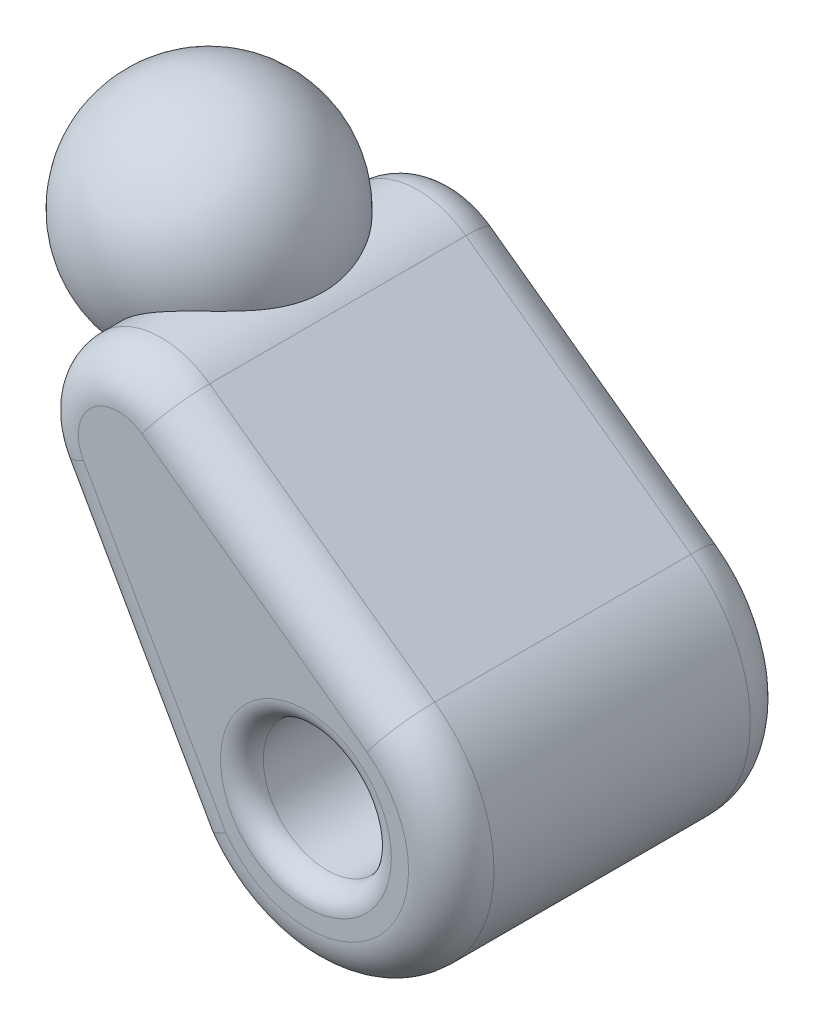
ISO-10303-21;
HEADER;
FILE_DESCRIPTION(('STEP AP214'),'2;1');
FILE_NAME('part.step','',(''),(''),'','','');
FILE_SCHEMA(('AUTOMOTIVE_DESIGN { 1 0 10303 214 1 1 1 1 }'));
ENDSEC;
DATA;
#1=APPLICATION_CONTEXT('core data for automotive mechanical design processes');
#2=APPLICATION_PROTOCOL_DEFINITION('international standard','automotive_design',2000,#1);
#3=PRODUCT_CONTEXT('',#1,'mechanical');
#4=PRODUCT('Part','Part','',(#3));
#5=PRODUCT_RELATED_PRODUCT_CATEGORY('part','',(#4));
#6=PRODUCT_DEFINITION_FORMATION('','',#4);
#7=PRODUCT_DEFINITION_CONTEXT('part definition',#1,'design');
#8=PRODUCT_DEFINITION('design','',#6,#7);
#9=PRODUCT_DEFINITION_SHAPE('','',#8);
#10=(LENGTH_UNIT() NAMED_UNIT(*) SI_UNIT(.MILLI.,.METRE.));
#11=(NAMED_UNIT(*) PLANE_ANGLE_UNIT() SI_UNIT($,.RADIAN.));
#12=(NAMED_UNIT(*) SI_UNIT($,.STERADIAN.) SOLID_ANGLE_UNIT());
#13=UNCERTAINTY_MEASURE_WITH_UNIT(LENGTH_MEASURE(1.E-05),#10,'distance_accuracy_value','');
#14=(GEOMETRIC_REPRESENTATION_CONTEXT(3) GLOBAL_UNCERTAINTY_ASSIGNED_CONTEXT((#13)) GLOBAL_UNIT_ASSIGNED_CONTEXT((#10,
#11,#12)) REPRESENTATION_CONTEXT('',''));
#15=CARTESIAN_POINT('',(0.,0.,0.));
#16=DIRECTION('',(0.,0.,1.));
#17=DIRECTION('',(1.,0.,0.));
#18=AXIS2_PLACEMENT_3D('',#15,#16,#17);
#19=CARTESIAN_POINT('',(0.,0.,0.));
#20=DIRECTION('',(-1.,0.,0.));
#21=DIRECTION('',(0.,1.,0.));
#22=AXIS2_PLACEMENT_3D('',#19,#20,#21);
#23=SPHERICAL_SURFACE('',#22,27.);
#24=CARTESIAN_POINT('',(26.7853137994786,-3.39808249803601,0.));
#25=CARTESIAN_POINT('',(26.7853137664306,-3.39808235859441,0.413216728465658));
#26=CARTESIAN_POINT('',(26.7762724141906,-3.39396342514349,0.826435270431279));
#27=CARTESIAN_POINT('',(26.7401156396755,-3.37759198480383,1.65192043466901));
#28=CARTESIAN_POINT('',(26.7130000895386,-3.36533942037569,2.06418705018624));
#29=CARTESIAN_POINT('',(26.6407185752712,-3.33301105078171,2.88685381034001));
#30=CARTESIAN_POINT('',(26.595551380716,-3.3129347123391,3.29725382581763));
#31=CARTESIAN_POINT('',(26.4872096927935,-3.26546918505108,4.11524096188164));
#32=CARTESIAN_POINT('',(26.4240352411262,-3.23808001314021,4.52282808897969));
#33=CARTESIAN_POINT('',(26.2796757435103,-3.17665948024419,5.33465464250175));
#34=CARTESIAN_POINT('',(26.1984753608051,-3.14262246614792,5.73889091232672));
#35=CARTESIAN_POINT('',(26.0181585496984,-3.06878807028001,6.54286475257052));
#36=CARTESIAN_POINT('',(25.9190398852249,-3.02898996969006,6.94260175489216));
#37=CARTESIAN_POINT('',(25.7030003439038,-2.94466954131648,7.73664736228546));
#38=CARTESIAN_POINT('',(25.5860831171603,-2.90014818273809,8.13095706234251));
#39=CARTESIAN_POINT('',(25.3345382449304,-2.8075421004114,8.91347287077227));
#40=CARTESIAN_POINT('',(25.1999089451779,-2.75945704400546,9.30167840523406));
#41=CARTESIAN_POINT('',(24.7990928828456,-2.62187726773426,10.3769583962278));
#42=CARTESIAN_POINT('',(24.5133414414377,-2.52982496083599,11.0565311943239));
#43=CARTESIAN_POINT('',(23.8860831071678,-2.34658542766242,12.3894988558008));
#44=CARTESIAN_POINT('',(23.544575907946,-2.25539820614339,13.0428935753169));
#45=CARTESIAN_POINT('',(22.8074502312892,-2.08313618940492,14.3188825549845));
#46=CARTESIAN_POINT('',(22.41189366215,-2.00205002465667,14.9415109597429));
#47=CARTESIAN_POINT('',(21.56824472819,-1.85972616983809,16.1524452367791));
#48=CARTESIAN_POINT('',(21.1201677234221,-1.79848269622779,16.7407610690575));
#49=CARTESIAN_POINT('',(20.2918536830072,-1.71772057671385,17.7369799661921));
#50=CARTESIAN_POINT('',(19.9224383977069,-1.69161448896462,18.1533783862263));
#51=CARTESIAN_POINT('',(19.1570927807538,-1.66107217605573,18.961978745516));
#52=CARTESIAN_POINT('',(18.7611643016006,-1.65663443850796,19.3541823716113));
#53=CARTESIAN_POINT('',(17.9454256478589,-1.67407713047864,20.1114053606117));
#54=CARTESIAN_POINT('',(17.525643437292,-1.69592732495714,20.4764554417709));
#55=CARTESIAN_POINT('',(16.6646480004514,-1.77052421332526,21.1769680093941));
#56=CARTESIAN_POINT('',(16.2234391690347,-1.82326459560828,21.5124365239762));
#57=CARTESIAN_POINT('',(15.4147032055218,-1.94976099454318,22.085785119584));
#58=CARTESIAN_POINT('',(15.0504019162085,-2.01707687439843,22.3296507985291));
#59=CARTESIAN_POINT('',(14.3128653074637,-2.17619881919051,22.7947880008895));
#60=CARTESIAN_POINT('',(13.9396319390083,-2.26799957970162,23.0160644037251));
#61=CARTESIAN_POINT('',(13.186907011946,-2.47791153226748,23.4342016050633));
#62=CARTESIAN_POINT('',(12.8074157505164,-2.59602147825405,23.6310635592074));
#63=CARTESIAN_POINT('',(12.0452990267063,-2.86000712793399,23.9984894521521));
#64=CARTESIAN_POINT('',(11.6626735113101,-3.005883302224,24.1690529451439));
#65=CARTESIAN_POINT('',(10.8946848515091,-3.3276867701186,24.4833004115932));
#66=CARTESIAN_POINT('',(10.5093253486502,-3.5038534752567,24.6267494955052));
#67=CARTESIAN_POINT('',(9.74306436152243,-3.88572409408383,24.8831975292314));
#68=CARTESIAN_POINT('',(9.36216296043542,-4.09142855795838,24.9961959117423));
#69=CARTESIAN_POINT('',(8.60934998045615,-4.53178282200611,25.1901064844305));
#70=CARTESIAN_POINT('',(8.23743236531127,-4.76641250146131,25.2710408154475));
#71=CARTESIAN_POINT('',(7.50666113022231,-5.2634459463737,25.3997146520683));
#72=CARTESIAN_POINT('',(7.14780544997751,-5.52584530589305,25.4474594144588));
#73=CARTESIAN_POINT('',(6.49526219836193,-6.03859088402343,25.5048146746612));
#74=CARTESIAN_POINT('',(6.19937684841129,-6.28567264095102,25.5187495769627));
#75=CARTESIAN_POINT('',(5.62284844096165,-6.7971054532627,25.5211946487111));
#76=CARTESIAN_POINT('',(5.34220375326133,-7.06145465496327,25.509707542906));
#77=CARTESIAN_POINT('',(4.79833048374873,-7.60518294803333,25.461453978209));
#78=CARTESIAN_POINT('',(4.53509783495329,-7.88455850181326,25.4246934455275));
#79=CARTESIAN_POINT('',(4.02769258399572,-8.45594859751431,25.3263306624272));
#80=CARTESIAN_POINT('',(3.78352007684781,-8.74796320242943,25.264728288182));
#81=CARTESIAN_POINT('',(3.32608495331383,-9.32858636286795,25.120707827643));
#82=CARTESIAN_POINT('',(3.11192477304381,-9.61675411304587,25.0393543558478));
#83=CARTESIAN_POINT('',(2.70287090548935,-10.1998691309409,24.8554308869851));
#84=CARTESIAN_POINT('',(2.50797631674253,-10.4948160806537,24.7528618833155));
#85=CARTESIAN_POINT('',(2.13777603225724,-11.0892040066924,24.5274289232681));
#86=CARTESIAN_POINT('',(1.96247123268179,-11.3886451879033,24.4045640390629));
#87=CARTESIAN_POINT('',(1.63144148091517,-11.9898012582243,24.1395605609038));
#88=CARTESIAN_POINT('',(1.47571767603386,-12.2915162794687,23.9974208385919));
#89=CARTESIAN_POINT('',(1.17129853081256,-12.9204213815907,23.6822651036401));
#90=CARTESIAN_POINT('',(1.02428447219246,-13.2476284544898,23.5076600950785));
#91=CARTESIAN_POINT('',(0.752148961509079,-13.8998181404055,23.1384590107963));
#92=CARTESIAN_POINT('',(0.627028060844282,-14.2248006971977,22.9438624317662));
#93=CARTESIAN_POINT('',(0.397598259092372,-14.8704969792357,22.5359550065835));
#94=CARTESIAN_POINT('',(0.293297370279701,-15.1912090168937,22.3226370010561));
#95=CARTESIAN_POINT('',(0.104301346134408,-15.8263576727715,21.8786352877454));
#96=CARTESIAN_POINT('',(0.0196101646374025,-16.1407930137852,21.6479480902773));
#97=CARTESIAN_POINT('',(-0.167297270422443,-16.9085232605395,21.0575121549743));
#98=CARTESIAN_POINT('',(-0.258869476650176,-17.3571870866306,20.6883081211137));
#99=CARTESIAN_POINT('',(-0.407360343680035,-18.2327871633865,19.918463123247));
#100=CARTESIAN_POINT('',(-0.464266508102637,-18.6597155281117,19.5178108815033));
#101=CARTESIAN_POINT('',(-0.548594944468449,-19.488980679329,18.6875695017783));
#102=CARTESIAN_POINT('',(-0.575965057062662,-19.8912727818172,18.257930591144));
#103=CARTESIAN_POINT('',(-0.606225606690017,-20.6676442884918,17.3731888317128));
#104=CARTESIAN_POINT('',(-0.609115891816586,-21.0417235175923,16.9180858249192));
#105=CARTESIAN_POINT('',(-0.593824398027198,-21.8495311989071,15.8678091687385));
#106=CARTESIAN_POINT('',(-0.570178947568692,-22.2747069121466,15.2661203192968));
#107=CARTESIAN_POINT('',(-0.502229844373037,-23.0742846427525,14.0309598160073));
#108=CARTESIAN_POINT('',(-0.45792123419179,-23.4486744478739,13.3974805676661));
#109=CARTESIAN_POINT('',(-0.357725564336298,-24.144176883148,12.1026218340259));
#110=CARTESIAN_POINT('',(-0.301835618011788,-24.4652761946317,11.4412354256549));
#111=CARTESIAN_POINT('',(-0.186876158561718,-25.0520595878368,10.0946559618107));
#112=CARTESIAN_POINT('',(-0.127806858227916,-25.3177473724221,9.40946450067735));
#113=CARTESIAN_POINT('',(-0.0134644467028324,-25.7942048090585,8.0131767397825));
#114=CARTESIAN_POINT('',(0.0417709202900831,-26.0044735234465,7.30190621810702));
#115=CARTESIAN_POINT('',(0.141397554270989,-26.3656862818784,5.86368573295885));
#116=CARTESIAN_POINT('',(0.185788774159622,-26.5166300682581,5.13673570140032));
#117=CARTESIAN_POINT('',(0.25875031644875,-26.7581094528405,3.67260674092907));
#118=CARTESIAN_POINT('',(0.287332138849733,-26.8486889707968,2.93543564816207));
#119=CARTESIAN_POINT('',(0.325614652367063,-26.968990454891,1.4556550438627));
#120=CARTESIAN_POINT('',(0.335315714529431,-26.998713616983,0.713045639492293));
#121=CARTESIAN_POINT('',(0.334793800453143,-26.997099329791,-0.769136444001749));
#122=CARTESIAN_POINT('',(0.324650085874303,-26.9660047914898,-1.50870942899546));
#123=CARTESIAN_POINT('',(0.285682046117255,-26.8434554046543,-2.98233589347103));
#124=CARTESIAN_POINT('',(0.256857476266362,-26.7519997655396,-3.71638930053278));
#125=CARTESIAN_POINT('',(0.183610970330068,-26.5092588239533,-5.1742980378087));
#126=CARTESIAN_POINT('',(0.139177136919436,-26.3579278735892,-5.89814514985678));
#127=CARTESIAN_POINT('',(0.0396354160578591,-25.9964263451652,-7.33021909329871));
#128=CARTESIAN_POINT('',(-0.0154724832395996,-25.7862557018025,-8.03844590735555));
#129=CARTESIAN_POINT('',(-0.129866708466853,-25.3087333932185,-9.43384549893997));
#130=CARTESIAN_POINT('',(-0.189146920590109,-25.0414642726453,-10.1210470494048));
#131=CARTESIAN_POINT('',(-0.304395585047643,-24.451172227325,-11.4714365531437));
#132=CARTESIAN_POINT('',(-0.360363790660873,-24.1281451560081,-12.1346227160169));
#133=CARTESIAN_POINT('',(-0.460476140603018,-23.4285386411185,-13.4327011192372));
#134=CARTESIAN_POINT('',(-0.504625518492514,-23.0519830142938,-14.0676057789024));
#135=CARTESIAN_POINT('',(-0.571932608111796,-22.2478144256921,-15.3053303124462));
#136=CARTESIAN_POINT('',(-0.595095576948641,-21.8202142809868,-15.9081581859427));
#137=CARTESIAN_POINT('',(-0.60902165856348,-21.0145476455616,-16.9515201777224));
#138=CARTESIAN_POINT('',(-0.60568516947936,-20.6456280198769,-17.3990595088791));
#139=CARTESIAN_POINT('',(-0.575213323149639,-19.880491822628,-18.2694011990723));
#140=CARTESIAN_POINT('',(-0.548079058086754,-19.48427650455,-18.6922046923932));
#141=CARTESIAN_POINT('',(-0.465119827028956,-18.6677399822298,-19.509851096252));
#142=CARTESIAN_POINT('',(-0.409332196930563,-18.2474507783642,-19.9047296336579));
#143=CARTESIAN_POINT('',(-0.26419119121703,-17.3856820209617,-20.6640540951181));
#144=CARTESIAN_POINT('',(-0.174845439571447,-16.9442073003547,-21.0285069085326));
#145=CARTESIAN_POINT('',(0.0187133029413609,-16.1411844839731,-21.6487462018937));
#146=CARTESIAN_POINT('',(0.115589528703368,-15.7828805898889,-21.9110398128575));
#147=CARTESIAN_POINT('',(0.334936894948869,-15.0583455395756,-22.4129468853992));
#148=CARTESIAN_POINT('',(0.457402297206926,-14.6921161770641,-22.6525654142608));
#149=CARTESIAN_POINT('',(0.729745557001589,-13.9545590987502,-23.1072278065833));
#150=CARTESIAN_POINT('',(0.879623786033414,-13.5832313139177,-23.3222713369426));
#151=CARTESIAN_POINT('',(1.20821130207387,-12.8388007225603,-23.7257590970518));
#152=CARTESIAN_POINT('',(1.3869211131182,-12.4656978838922,-23.9142028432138));
#153=CARTESIAN_POINT('',(1.77580547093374,-11.7181204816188,-24.2640091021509));
#154=CARTESIAN_POINT('',(1.98624868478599,-11.3436637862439,-24.4251126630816));
#155=CARTESIAN_POINT('',(2.43762730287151,-10.6009747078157,-24.7161343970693));
#156=CARTESIAN_POINT('',(2.67856337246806,-10.2327424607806,-24.8460518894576));
#157=CARTESIAN_POINT('',(3.1901116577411,-9.50727174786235,-25.0727871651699));
#158=CARTESIAN_POINT('',(3.46069961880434,-9.15002459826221,-25.1696317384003));
#159=CARTESIAN_POINT('',(4.03018252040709,-8.45075804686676,-25.3288745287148));
#160=CARTESIAN_POINT('',(4.32907231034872,-8.10873589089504,-25.3912789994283));
#161=CARTESIAN_POINT('',(4.90707458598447,-7.49284128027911,-25.4741202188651));
#162=CARTESIAN_POINT('',(5.1826891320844,-7.2163162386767,-25.4993590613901));
#163=CARTESIAN_POINT('',(5.75074776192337,-6.67993312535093,-25.523716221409));
#164=CARTESIAN_POINT('',(6.04318992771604,-6.4200731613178,-25.5228375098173));
#165=CARTESIAN_POINT('',(6.64244235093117,-5.91918675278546,-25.4949770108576));
#166=CARTESIAN_POINT('',(6.94924849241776,-5.67815496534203,-25.4680026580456));
#167=CARTESIAN_POINT('',(7.57464550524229,-5.21651815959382,-25.3882909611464));
#168=CARTESIAN_POINT('',(7.89323630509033,-4.99591301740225,-25.335553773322));
#169=CARTESIAN_POINT('',(8.51989530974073,-4.58897336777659,-25.2088782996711));
#170=CARTESIAN_POINT('',(8.8274428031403,-4.40137536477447,-25.1364070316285));
#171=CARTESIAN_POINT('',(9.44802549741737,-4.04588631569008,-24.9699900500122));
#172=CARTESIAN_POINT('',(9.76106037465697,-3.87799411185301,-24.8760455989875));
#173=CARTESIAN_POINT('',(10.3902775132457,-3.56212700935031,-24.6675531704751));
#174=CARTESIAN_POINT('',(10.7064598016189,-3.41415228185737,-24.553005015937));
#175=CARTESIAN_POINT('',(11.3397338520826,-3.13798323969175,-24.3042857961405));
#176=CARTESIAN_POINT('',(11.6568256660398,-3.00979007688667,-24.1701135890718));
#177=CARTESIAN_POINT('',(12.3127281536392,-2.7641744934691,-23.8728102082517));
#178=CARTESIAN_POINT('',(12.6514500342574,-2.64820276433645,-23.708286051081));
#179=CARTESIAN_POINT('',(13.3251627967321,-2.43764885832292,-23.3592154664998));
#180=CARTESIAN_POINT('',(13.6601536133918,-2.34306705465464,-23.1746686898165));
#181=CARTESIAN_POINT('',(14.3244623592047,-2.1741191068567,-22.7867966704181));
#182=CARTESIAN_POINT('',(14.6537780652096,-2.09976072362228,-22.5834642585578));
#183=CARTESIAN_POINT('',(15.3048366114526,-1.96995388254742,-22.1593433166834));
#184=CARTESIAN_POINT('',(15.6265779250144,-1.9145092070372,-21.938551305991));
#185=CARTESIAN_POINT('',(16.4062526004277,-1.79965561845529,-21.3758251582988));
#186=CARTESIAN_POINT('',(16.8590626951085,-1.75006418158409,-21.024726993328));
#187=CARTESIAN_POINT('',(17.7413262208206,-1.68305240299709,-20.2914538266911));
#188=CARTESIAN_POINT('',(18.1707714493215,-1.66564328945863,-19.9092680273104));
#189=CARTESIAN_POINT('',(19.0039308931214,-1.6578934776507,-19.1163083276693));
#190=CARTESIAN_POINT('',(19.4076013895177,-1.66759758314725,-18.7054882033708));
#191=CARTESIAN_POINT('',(20.1861629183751,-1.70903438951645,-17.8585950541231));
#192=CARTESIAN_POINT('',(20.5610535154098,-1.74076742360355,-17.4225216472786));
#193=CARTESIAN_POINT('',(21.3753624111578,-1.83185080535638,-16.4093626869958));
#194=CARTESIAN_POINT('',(21.8057115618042,-1.89627850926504,-15.8254265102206));
#195=CARTESIAN_POINT('',(22.6154635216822,-2.04252772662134,-14.6252715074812));
#196=CARTESIAN_POINT('',(22.9948541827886,-2.12435337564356,-14.0090450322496));
#197=CARTESIAN_POINT('',(23.7012512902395,-2.29625284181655,-12.7478601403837));
#198=CARTESIAN_POINT('',(24.0282238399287,-2.38633193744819,-12.1028834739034));
#199=CARTESIAN_POINT('',(24.6283503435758,-2.56616813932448,-10.7883928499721));
#200=CARTESIAN_POINT('',(24.9015042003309,-2.65592524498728,-10.1188788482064));
#201=CARTESIAN_POINT('',(25.4191795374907,-2.83647062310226,-8.68718918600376));
#202=CARTESIAN_POINT('',(25.6576431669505,-2.92636931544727,-7.92268781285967));
#203=CARTESIAN_POINT('',(25.9646248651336,-3.04720653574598,-6.76129028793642));
#204=CARTESIAN_POINT('',(26.0585129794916,-3.0851564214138,-6.37164054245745));
#205=CARTESIAN_POINT('',(26.2293212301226,-3.15549122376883,-5.58815505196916));
#206=CARTESIAN_POINT('',(26.3062433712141,-3.18787679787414,-5.19431980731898));
#207=CARTESIAN_POINT('',(26.443015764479,-3.24627637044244,-4.40345773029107));
#208=CARTESIAN_POINT('',(26.5028753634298,-3.27229385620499,-4.00643276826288));
#209=CARTESIAN_POINT('',(26.6055240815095,-3.31735353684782,-3.20983050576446));
#210=CARTESIAN_POINT('',(26.6483151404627,-3.33639652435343,-2.81025350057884));
#211=CARTESIAN_POINT('',(26.7168000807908,-3.36705334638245,-2.00931466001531));
#212=CARTESIAN_POINT('',(26.7424923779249,-3.37866649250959,-1.60795266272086));
#213=CARTESIAN_POINT('',(26.7767483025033,-3.39418070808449,-0.804394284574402));
#214=CARTESIAN_POINT('',(26.7853138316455,-3.39808263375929,-0.402198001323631));
#215=CARTESIAN_POINT('',(26.7853137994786,-3.39808249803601,0.));
#216=B_SPLINE_CURVE_WITH_KNOTS('',3,(#24,#25,#26,#27,#28,#29,#30,#31,#32,#33,#34,#35,#36,#37,
#38,#39,#40,#41,#42,#43,#44,#45,#46,#47,#48,#49,#50,#51,#52,#53,#54,#55,#56,#57,#58,#59,#60,#61,
#62,#63,#64,#65,#66,#67,#68,#69,#70,#71,#72,#73,#74,#75,#76,#77,#78,#79,#80,#81,#82,#83,#84,#85,
#86,#87,#88,#89,#90,#91,#92,#93,#94,#95,#96,#97,#98,#99,#100,#101,#102,#103,#104,#105,#106,#107,
#108,#109,#110,#111,#112,#113,#114,#115,#116,#117,#118,#119,#120,#121,#122,#123,#124,#125,#126,
#127,#128,#129,#130,#131,#132,#133,#134,#135,#136,#137,#138,#139,#140,#141,#142,#143,#144,#145,
#146,#147,#148,#149,#150,#151,#152,#153,#154,#155,#156,#157,#158,#159,#160,#161,#162,#163,#164,
#165,#166,#167,#168,#169,#170,#171,#172,#173,#174,#175,#176,#177,#178,#179,#180,#181,#182,#183,
#184,#185,#186,#187,#188,#189,#190,#191,#192,#193,#194,#195,#196,#197,#198,#199,#200,#201,#202,
#203,#204,#205,#206,#207,#208,#209,#210,#211,#212,#213,#214,#215),.UNSPECIFIED.,.T.,.F.,(4,2,2,
2,2,2,2,2,2,2,2,2,2,2,2,2,2,2,2,2,2,2,2,2,2,2,2,2,2,2,2,2,2,2,2,2,2,2,2,2,2,2,2,2,2,2,2,2,2,2,2,
2,2,2,2,2,2,2,2,2,2,2,2,2,2,2,2,2,2,2,2,2,2,2,2,2,2,2,2,2,2,2,2,2,2,2,2,2,2,2,2,2,2,2,2,4),(0.,
1.23953419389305,2.47907715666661,3.71870462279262,4.95832921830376,6.19901257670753,
7.43985087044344,8.68043503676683,9.92113515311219,12.147204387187,14.3732858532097,
16.5968386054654,18.8197426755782,20.4901084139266,22.1603575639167,23.8286875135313,
25.4966767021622,26.8260411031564,28.155117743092,29.484131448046,30.8131676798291,
32.1532366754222,33.4933306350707,34.8324976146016,36.1714524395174,37.3271771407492,
38.482777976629,39.6381079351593,40.7934436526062,41.8966506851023,42.9998060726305,
44.1030119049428,45.2062823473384,46.4019647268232,47.5976772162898,48.7938489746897,
49.9902617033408,51.7523010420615,53.5149751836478,55.2807570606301,57.0465498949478,
59.2549681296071,61.463916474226,63.673416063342,65.8827679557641,68.1114539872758,
70.3401496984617,72.567222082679,74.7942506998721,77.0124025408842,79.2305834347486,
81.4504586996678,83.6703364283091,85.8870264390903,88.1038813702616,90.3197530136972,
92.5350694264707,94.273585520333,96.0120218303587,97.74819864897,99.4839812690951,
100.846235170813,102.208183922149,103.570151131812,104.932143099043,106.306391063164,
107.68066901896,109.053831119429,110.426743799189,111.598920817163,112.770964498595,
113.942674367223,115.114377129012,116.21556082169,117.316679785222,118.41780821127,
119.519000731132,120.699879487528,121.880778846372,123.062130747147,124.243718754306,
125.966544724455,127.689971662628,129.416248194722,131.142550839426,133.324287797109,
135.506543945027,137.690205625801,139.873871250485,142.287834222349,143.495280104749,
144.702583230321,145.909223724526,147.115727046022,148.322342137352,149.528823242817),.UNSPECIFIED.);
#217=CARTESIAN_POINT('',(26.7853137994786,-3.39808249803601,0.));
#218=VERTEX_POINT('',#217);
#219=EDGE_CURVE('E123',#218,#218,#216,.T.);
#220=ORIENTED_EDGE('',*,*,#219,.F.);
#221=EDGE_LOOP('',(#220));
#222=FACE_BOUND('',#221,.T.);
#223=ADVANCED_FACE('F34',(#222),#23,.T.);
#224=CARTESIAN_POINT('',(18.7672145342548,-21.0339405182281,40.));
#225=DIRECTION('',(0.,0.,-1.));
#226=DIRECTION('',(-1.,0.,0.));
#227=AXIS2_PLACEMENT_3D('',#224,#225,#226);
#228=CYLINDRICAL_SURFACE('',#227,19.3730070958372);
#229=DIRECTION('',(0.,0.,-1.));
#230=VECTOR('',#229,1.);
#231=CARTESIAN_POINT('',(30.1378789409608,-5.34887134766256,40.));
#232=LINE('',#231,#230);
#233=CARTESIAN_POINT('',(30.1378789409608,-5.34887134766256,30.));
#234=VERTEX_POINT('',#233);
#235=CARTESIAN_POINT('',(30.1378789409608,-5.34887134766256,-30.));
#236=VERTEX_POINT('',#235);
#237=EDGE_CURVE('E105',#234,#236,#232,.T.);
#238=ORIENTED_EDGE('',*,*,#237,.T.);
#239=CARTESIAN_POINT('',(18.7672145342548,-21.0339405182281,-30.));
#240=DIRECTION('',(0.,0.,1.));
#241=DIRECTION('',(1.,0.,0.));
#242=AXIS2_PLACEMENT_3D('',#239,#240,#241);
#243=CIRCLE('',#242,19.3730070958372);
#244=CARTESIAN_POINT('',(1.91163510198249,-30.5839586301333,-30.));
#245=VERTEX_POINT('',#244);
#246=EDGE_CURVE('E371',#236,#245,#243,.T.);
#247=ORIENTED_EDGE('',*,*,#246,.T.);
#248=DIRECTION('',(0.,0.,-1.));
#249=VECTOR('',#248,1.);
#250=CARTESIAN_POINT('',(1.91163510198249,-30.5839586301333,40.));
#251=LINE('',#250,#249);
#252=CARTESIAN_POINT('',(1.91163510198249,-30.5839586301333,30.));
#253=VERTEX_POINT('',#252);
#254=EDGE_CURVE('E363',#253,#245,#251,.T.);
#255=ORIENTED_EDGE('',*,*,#254,.F.);
#256=CARTESIAN_POINT('',(18.7672145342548,-21.0339405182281,30.));
#257=DIRECTION('',(0.,0.,1.));
#258=DIRECTION('',(1.,0.,0.));
#259=AXIS2_PLACEMENT_3D('',#256,#257,#258);
#260=CIRCLE('',#259,19.3730070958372);
#261=EDGE_CURVE('E372',#253,#234,#260,.F.);
#262=ORIENTED_EDGE('',*,*,#261,.T.);
#263=EDGE_LOOP('',(#238,#247,#255,#262));
#264=FACE_BOUND('',#263,.T.);
#265=ORIENTED_EDGE('',*,*,#219,.T.);
#266=EDGE_LOOP('',(#265));
#267=FACE_BOUND('',#266,.T.);
#268=ADVANCED_FACE('F174',(#264,#267),#228,.T.);
#269=CARTESIAN_POINT('',(63.1288934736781,-70.7536746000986,40.));
#270=DIRECTION('',(0.,0.,-1.));
#271=DIRECTION('',(-1.,0.,0.));
#272=AXIS2_PLACEMENT_3D('',#269,#270,#271);
#273=CYLINDRICAL_SURFACE('',#272,33.5905058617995);
#274=DIRECTION('',(0.,0.,-1.));
#275=VECTOR('',#274,1.);
#276=CARTESIAN_POINT('',(35.4717378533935,-89.8168282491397,40.));
#277=LINE('',#276,#275);
#278=CARTESIAN_POINT('',(35.4717378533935,-89.8168282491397,30.));
#279=VERTEX_POINT('',#278);
#280=CARTESIAN_POINT('',(35.4717378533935,-89.8168282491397,-30.));
#281=VERTEX_POINT('',#280);
#282=EDGE_CURVE('E359',#279,#281,#277,.T.);
#283=ORIENTED_EDGE('',*,*,#282,.T.);
#284=CARTESIAN_POINT('',(63.1288934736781,-70.7536746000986,-30.));
#285=DIRECTION('',(0.,0.,1.));
#286=DIRECTION('',(1.,0.,0.));
#287=AXIS2_PLACEMENT_3D('',#284,#285,#286);
#288=CIRCLE('',#287,33.5905058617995);
#289=CARTESIAN_POINT('',(82.8442823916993,-43.5576174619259,-30.));
#290=VERTEX_POINT('',#289);
#291=EDGE_CURVE('E122',#281,#290,#288,.T.);
#292=ORIENTED_EDGE('',*,*,#291,.T.);
#293=DIRECTION('',(0.,0.,-1.));
#294=VECTOR('',#293,1.);
#295=CARTESIAN_POINT('',(82.8442823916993,-43.5576174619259,40.));
#296=LINE('',#295,#294);
#297=CARTESIAN_POINT('',(82.8442823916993,-43.5576174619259,30.));
#298=VERTEX_POINT('',#297);
#299=EDGE_CURVE('E103',#298,#290,#296,.T.);
#300=ORIENTED_EDGE('',*,*,#299,.F.);
#301=CARTESIAN_POINT('',(63.1288934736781,-70.7536746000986,30.));
#302=DIRECTION('',(0.,0.,1.));
#303=DIRECTION('',(1.,0.,0.));
#304=AXIS2_PLACEMENT_3D('',#301,#302,#303);
#305=CIRCLE('',#304,33.5905058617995);
#306=EDGE_CURVE('E119',#298,#279,#305,.F.);
#307=ORIENTED_EDGE('',*,*,#306,.T.);
#308=EDGE_LOOP('',(#283,#292,#300,#307));
#309=FACE_BOUND('',#308,.T.);
#310=ADVANCED_FACE('F118',(#309),#273,.T.);
#311=CARTESIAN_POINT('',(30.1378789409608,-5.34887134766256,40.));
#312=DIRECTION('',(-0.586933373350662,-0.809635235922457,0.));
#313=DIRECTION('',(0.809635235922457,-0.586933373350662,0.));
#314=AXIS2_PLACEMENT_3D('',#311,#312,#313);
#315=PLANE('',#314);
#316=ORIENTED_EDGE('',*,*,#299,.T.);
#317=DIRECTION('',(-0.809635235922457,0.586933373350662,0.));
#318=VECTOR('',#317,1.);
#319=CARTESIAN_POINT('',(30.1378789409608,-5.34887134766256,-30.));
#320=LINE('',#319,#318);
#321=EDGE_CURVE('E110',#290,#236,#320,.T.);
#322=ORIENTED_EDGE('',*,*,#321,.T.);
#323=ORIENTED_EDGE('',*,*,#237,.F.);
#324=DIRECTION('',(-0.809635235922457,0.586933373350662,0.));
#325=VECTOR('',#324,1.);
#326=CARTESIAN_POINT('',(82.8442823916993,-43.5576174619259,30.));
#327=LINE('',#326,#325);
#328=EDGE_CURVE('E100',#234,#298,#327,.F.);
#329=ORIENTED_EDGE('',*,*,#328,.T.);
#330=EDGE_LOOP('',(#316,#322,#323,#329));
#331=FACE_BOUND('',#330,.T.);
#332=ADVANCED_FACE('F102',(#331),#315,.F.);
#333=CARTESIAN_POINT('',(1.91163510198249,-30.5839586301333,40.));
#334=DIRECTION('',(0.870054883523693,0.492954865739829,0.));
#335=DIRECTION('',(-0.492954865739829,0.870054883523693,0.));
#336=AXIS2_PLACEMENT_3D('',#333,#334,#335);
#337=PLANE('',#336);
#338=ORIENTED_EDGE('',*,*,#254,.T.);
#339=DIRECTION('',(0.492954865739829,-0.870054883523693,0.));
#340=VECTOR('',#339,1.);
#341=CARTESIAN_POINT('',(1.91163510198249,-30.5839586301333,-30.));
#342=LINE('',#341,#340);
#343=EDGE_CURVE('E376',#245,#281,#342,.T.);
#344=ORIENTED_EDGE('',*,*,#343,.T.);
#345=ORIENTED_EDGE('',*,*,#282,.F.);
#346=DIRECTION('',(0.492954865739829,-0.870054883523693,0.));
#347=VECTOR('',#346,1.);
#348=CARTESIAN_POINT('',(1.91163510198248,-30.5839586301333,30.));
#349=LINE('',#348,#347);
#350=EDGE_CURVE('E330',#279,#253,#349,.F.);
#351=ORIENTED_EDGE('',*,*,#350,.T.);
#352=EDGE_LOOP('',(#338,#344,#345,#351));
#353=FACE_BOUND('',#352,.T.);
#354=ADVANCED_FACE('F197',(#353),#337,.F.);
#355=CARTESIAN_POINT('',(63.1288934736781,-70.7536746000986,40.));
#356=DIRECTION('',(0.,0.,1.));
#357=DIRECTION('',(1.,0.,0.));
#358=AXIS2_PLACEMENT_3D('',#355,#356,#357);
#359=PLANE('',#358);
#360=CARTESIAN_POINT('',(62.6862769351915,-70.2575983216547,40.));
#361=DIRECTION('',(0.,0.,1.));
#362=DIRECTION('',(1.,0.,0.));
#363=AXIS2_PLACEMENT_3D('',#360,#361,#362);
#364=CIRCLE('',#363,20.);
#365=CARTESIAN_POINT('',(82.6862769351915,-70.2575983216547,40.));
#366=VERTEX_POINT('',#365);
#367=EDGE_CURVE('E11',#366,#366,#364,.F.);
#368=ORIENTED_EDGE('',*,*,#367,.T.);
#369=EDGE_LOOP('',(#368));
#370=FACE_BOUND('',#369,.T.);
#371=DIRECTION('',(0.492954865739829,-0.870054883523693,0.));
#372=VECTOR('',#371,1.);
#373=CARTESIAN_POINT('',(44.1722866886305,-84.8872795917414,40.));
#374=LINE('',#373,#372);
#375=CARTESIAN_POINT('',(10.6121839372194,-25.654409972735,40.));
#376=VERTEX_POINT('',#375);
#377=CARTESIAN_POINT('',(43.9360676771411,-84.4703580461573,40.));
#378=VERTEX_POINT('',#377);
#379=EDGE_CURVE('E49',#376,#378,#374,.T.);
#380=ORIENTED_EDGE('',*,*,#379,.T.);
#381=CARTESIAN_POINT('',(63.1288934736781,-70.7536746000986,40.));
#382=DIRECTION('',(0.,0.,1.));
#383=DIRECTION('',(1.,0.,0.));
#384=AXIS2_PLACEMENT_3D('',#381,#382,#383);
#385=CIRCLE('',#384,23.5905058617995);
#386=CARTESIAN_POINT('',(76.9749486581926,-51.6539698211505,40.));
#387=VERTEX_POINT('',#386);
#388=EDGE_CURVE('E111',#378,#387,#385,.T.);
#389=ORIENTED_EDGE('',*,*,#388,.T.);
#390=DIRECTION('',(-0.809635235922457,0.586933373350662,0.));
#391=VECTOR('',#390,1.);
#392=CARTESIAN_POINT('',(24.2685452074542,-13.4452237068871,40.));
#393=LINE('',#392,#391);
#394=CARTESIAN_POINT('',(24.2685452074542,-13.4452237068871,40.));
#395=VERTEX_POINT('',#394);
#396=EDGE_CURVE('E134',#387,#395,#393,.T.);
#397=ORIENTED_EDGE('',*,*,#396,.T.);
#398=CARTESIAN_POINT('',(18.7672145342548,-21.0339405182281,40.));
#399=DIRECTION('',(0.,0.,1.));
#400=DIRECTION('',(1.,0.,0.));
#401=AXIS2_PLACEMENT_3D('',#398,#399,#400);
#402=CIRCLE('',#401,9.37300709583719);
#403=EDGE_CURVE('E54',#395,#376,#402,.T.);
#404=ORIENTED_EDGE('',*,*,#403,.T.);
#405=EDGE_LOOP('',(#380,#389,#397,#404));
#406=FACE_BOUND('',#405,.T.);
#407=ADVANCED_FACE('F204',(#370,#406),#359,.T.);
#408=CARTESIAN_POINT('',(63.1288934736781,-70.7536746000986,-40.));
#409=DIRECTION('',(0.,0.,1.));
#410=DIRECTION('',(1.,0.,0.));
#411=AXIS2_PLACEMENT_3D('',#408,#409,#410);
#412=PLANE('',#411);
#413=CARTESIAN_POINT('',(62.6862769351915,-70.2575983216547,-40.));
#414=DIRECTION('',(0.,0.,1.));
#415=DIRECTION('',(1.,0.,0.));
#416=AXIS2_PLACEMENT_3D('',#413,#414,#415);
#417=CIRCLE('',#416,20.);
#418=CARTESIAN_POINT('',(82.6862769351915,-70.2575983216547,-40.));
#419=VERTEX_POINT('',#418);
#420=EDGE_CURVE('E336',#419,#419,#417,.T.);
#421=ORIENTED_EDGE('',*,*,#420,.T.);
#422=EDGE_LOOP('',(#421));
#423=FACE_BOUND('',#422,.T.);
#424=DIRECTION('',(-0.809635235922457,0.586933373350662,0.));
#425=VECTOR('',#424,1.);
#426=CARTESIAN_POINT('',(76.9749486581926,-51.6539698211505,-40.));
#427=LINE('',#426,#425);
#428=CARTESIAN_POINT('',(24.2685452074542,-13.4452237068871,-40.));
#429=VERTEX_POINT('',#428);
#430=CARTESIAN_POINT('',(76.9749486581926,-51.6539698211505,-40.));
#431=VERTEX_POINT('',#430);
#432=EDGE_CURVE('E390',#429,#431,#427,.F.);
#433=ORIENTED_EDGE('',*,*,#432,.T.);
#434=CARTESIAN_POINT('',(63.1288934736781,-70.7536746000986,-40.));
#435=DIRECTION('',(0.,0.,1.));
#436=DIRECTION('',(1.,0.,0.));
#437=AXIS2_PLACEMENT_3D('',#434,#435,#436);
#438=CIRCLE('',#437,23.5905058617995);
#439=CARTESIAN_POINT('',(43.9360676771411,-84.4703580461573,-40.));
#440=VERTEX_POINT('',#439);
#441=EDGE_CURVE('E383',#431,#440,#438,.F.);
#442=ORIENTED_EDGE('',*,*,#441,.T.);
#443=DIRECTION('',(0.492954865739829,-0.870054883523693,0.));
#444=VECTOR('',#443,1.);
#445=CARTESIAN_POINT('',(42.7169555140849,-82.3186509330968,-40.));
#446=LINE('',#445,#444);
#447=CARTESIAN_POINT('',(10.6121839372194,-25.654409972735,-40.));
#448=VERTEX_POINT('',#447);
#449=EDGE_CURVE('E386',#440,#448,#446,.F.);
#450=ORIENTED_EDGE('',*,*,#449,.T.);
#451=CARTESIAN_POINT('',(18.7672145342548,-21.0339405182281,-40.));
#452=DIRECTION('',(0.,0.,1.));
#453=DIRECTION('',(1.,0.,0.));
#454=AXIS2_PLACEMENT_3D('',#451,#452,#453);
#455=CIRCLE('',#454,9.37300709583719);
#456=EDGE_CURVE('E388',#448,#429,#455,.F.);
#457=ORIENTED_EDGE('',*,*,#456,.T.);
#458=EDGE_LOOP('',(#433,#442,#450,#457));
#459=FACE_BOUND('',#458,.T.);
#460=ADVANCED_FACE('F238',(#423,#459),#412,.F.);
#461=CARTESIAN_POINT('',(18.7672145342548,-21.0339405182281,-30.));
#462=DIRECTION('',(0.,0.,1.));
#463=DIRECTION('',(1.,0.,0.));
#464=AXIS2_PLACEMENT_3D('',#461,#462,#463);
#465=DEGENERATE_TOROIDAL_SURFACE('',#464,9.37300709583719,10.,.T.);
#466=CARTESIAN_POINT('',(24.2685452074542,-13.4452237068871,-30.));
#467=DIRECTION('',(0.809635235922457,-0.586933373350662,0.));
#468=DIRECTION('',(0.586933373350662,0.809635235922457,0.));
#469=AXIS2_PLACEMENT_3D('',#466,#467,#468);
#470=CIRCLE('',#469,10.);
#471=EDGE_CURVE('E353',#429,#236,#470,.T.);
#472=ORIENTED_EDGE('',*,*,#471,.F.);
#473=ORIENTED_EDGE('',*,*,#456,.F.);
#474=CARTESIAN_POINT('',(10.6121839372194,-25.654409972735,-30.));
#475=DIRECTION('',(0.492954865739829,-0.870054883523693,0.));
#476=DIRECTION('',(0.870054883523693,0.492954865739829,0.));
#477=AXIS2_PLACEMENT_3D('',#474,#475,#476);
#478=CIRCLE('',#477,10.);
#479=EDGE_CURVE('E139',#245,#448,#478,.T.);
#480=ORIENTED_EDGE('',*,*,#479,.F.);
#481=ORIENTED_EDGE('',*,*,#246,.F.);
#482=EDGE_LOOP('',(#472,#473,#480,#481));
#483=FACE_BOUND('',#482,.T.);
#484=ADVANCED_FACE('F248',(#483),#465,.T.);
#485=CARTESIAN_POINT('',(10.6121839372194,-25.654409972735,-30.));
#486=DIRECTION('',(0.492954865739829,-0.870054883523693,0.));
#487=DIRECTION('',(0.870054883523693,0.492954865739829,0.));
#488=AXIS2_PLACEMENT_3D('',#485,#486,#487);
#489=CYLINDRICAL_SURFACE('',#488,10.);
#490=ORIENTED_EDGE('',*,*,#479,.T.);
#491=ORIENTED_EDGE('',*,*,#449,.F.);
#492=CARTESIAN_POINT('',(35.4717378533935,-89.8168282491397,-30.));
#493=CARTESIAN_POINT('',(35.4717117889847,-89.8168438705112,-30.2810444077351));
#494=CARTESIAN_POINT('',(35.4817879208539,-89.8105345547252,-30.56208437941));
#495=CARTESIAN_POINT('',(35.5219562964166,-89.785378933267,-31.1221523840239));
#496=CARTESIAN_POINT('',(35.5520475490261,-89.7665332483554,-31.4011805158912));
#497=CARTESIAN_POINT('',(35.6320292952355,-89.716435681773,-31.9550517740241));
#498=CARTESIAN_POINT('',(35.6819056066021,-89.6851926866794,-32.2298977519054));
#499=CARTESIAN_POINT('',(35.8010883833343,-89.6105218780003,-32.7736538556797));
#500=CARTESIAN_POINT('',(35.8703946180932,-89.5670942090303,-33.0425640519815));
#501=CARTESIAN_POINT('',(36.0279755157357,-89.4683301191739,-33.5726648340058));
#502=CARTESIAN_POINT('',(36.116258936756,-89.4129881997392,-33.83385179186));
#503=CARTESIAN_POINT('',(36.3111387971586,-89.2907896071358,-34.3465263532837));
#504=CARTESIAN_POINT('',(36.4177356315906,-89.2239326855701,-34.5980137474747));
#505=CARTESIAN_POINT('',(36.6484444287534,-89.0791844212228,-35.0894406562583));
#506=CARTESIAN_POINT('',(36.7725523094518,-89.00129565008,-35.3293828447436));
#507=CARTESIAN_POINT('',(37.0374059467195,-88.8350111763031,-35.7960795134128));
#508=CARTESIAN_POINT('',(37.178151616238,-88.7466155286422,-36.0228340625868));
#509=CARTESIAN_POINT('',(37.4753189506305,-88.5598956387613,-36.4616272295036));
#510=CARTESIAN_POINT('',(37.6317460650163,-88.4615679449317,-36.6736606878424));
#511=CARTESIAN_POINT('',(37.9591084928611,-88.2556898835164,-37.0814235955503));
#512=CARTESIAN_POINT('',(38.1300438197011,-88.1481395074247,-37.2771530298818));
#513=CARTESIAN_POINT('',(38.485248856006,-87.9245246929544,-37.6509827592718));
#514=CARTESIAN_POINT('',(38.6695227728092,-87.8084575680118,-37.8290774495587));
#515=CARTESIAN_POINT('',(39.0500283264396,-87.5686449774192,-38.1663055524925));
#516=CARTESIAN_POINT('',(39.2462597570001,-87.4448996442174,-38.3254392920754));
#517=CARTESIAN_POINT('',(39.6495098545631,-87.1904365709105,-38.6238005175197));
#518=CARTESIAN_POINT('',(39.8565408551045,-87.059710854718,-38.7630045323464));
#519=CARTESIAN_POINT('',(40.2796860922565,-86.7923301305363,-39.0202995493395));
#520=CARTESIAN_POINT('',(40.4958001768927,-86.6556752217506,-39.1383909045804));
#521=CARTESIAN_POINT('',(40.9354348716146,-86.3774645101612,-39.3525671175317));
#522=CARTESIAN_POINT('',(41.1589509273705,-86.2359117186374,-39.4486652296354));
#523=CARTESIAN_POINT('',(41.6118325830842,-85.9488610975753,-39.6182440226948));
#524=CARTESIAN_POINT('',(41.8411964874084,-85.8033644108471,-39.6917311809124));
#525=CARTESIAN_POINT('',(42.3701076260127,-85.4675499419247,-39.8332396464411));
#526=CARTESIAN_POINT('',(42.6710622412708,-85.2762539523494,-39.8937617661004));
#527=CARTESIAN_POINT('',(43.276093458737,-84.8911987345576,-39.975903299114));
#528=CARTESIAN_POINT('',(43.5801639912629,-84.6974441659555,-39.9975876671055));
#529=CARTESIAN_POINT('',(43.9013536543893,-84.4925097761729,-39.9999366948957));
#530=CARTESIAN_POINT('',(43.9187112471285,-84.4814339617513,-40.0000001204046));
#531=CARTESIAN_POINT('',(43.9360676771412,-84.4703580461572,-40.));
#532=B_SPLINE_CURVE_WITH_KNOTS('',3,(#492,#493,#494,#495,#496,#497,#498,#499,#500,#501,#502,
#503,#504,#505,#506,#507,#508,#509,#510,#511,#512,#513,#514,#515,#516,#517,#518,#519,#520,#521,
#522,#523,#524,#525,#526,#527,#528,#529,#530,#531),.UNSPECIFIED.,.F.,.F.,(4,2,2,2,2,2,2,2,2,2,2,
2,2,2,2,2,2,2,2,4),(0.,0.842875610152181,1.68570948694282,2.52794029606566,3.3701611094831,
4.21277145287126,5.05539997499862,5.89783239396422,6.74026040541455,7.5829821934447,
8.42570475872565,9.26869430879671,10.1116693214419,10.9556290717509,11.7995747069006,
12.6430103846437,13.4862042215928,14.5692168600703,15.6504165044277,15.7121871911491),.UNSPECIFIED.);
#533=EDGE_CURVE('E333',#281,#440,#532,.T.);
#534=ORIENTED_EDGE('',*,*,#533,.F.);
#535=ORIENTED_EDGE('',*,*,#343,.F.);
#536=EDGE_LOOP('',(#490,#491,#534,#535));
#537=FACE_BOUND('',#536,.T.);
#538=ADVANCED_FACE('F256',(#537),#489,.T.);
#539=CARTESIAN_POINT('',(24.2685452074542,-13.4452237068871,-30.));
#540=DIRECTION('',(-0.809635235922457,0.586933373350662,0.));
#541=DIRECTION('',(-0.586933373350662,-0.809635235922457,0.));
#542=AXIS2_PLACEMENT_3D('',#539,#540,#541);
#543=CYLINDRICAL_SURFACE('',#542,10.);
#544=ORIENTED_EDGE('',*,*,#471,.T.);
#545=ORIENTED_EDGE('',*,*,#321,.F.);
#546=CARTESIAN_POINT('',(76.9749486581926,-51.6539698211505,-30.));
#547=DIRECTION('',(0.809635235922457,-0.586933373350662,0.));
#548=DIRECTION('',(0.586933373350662,0.809635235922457,0.));
#549=AXIS2_PLACEMENT_3D('',#546,#547,#548);
#550=CIRCLE('',#549,10.);
#551=EDGE_CURVE('E332',#431,#290,#550,.T.);
#552=ORIENTED_EDGE('',*,*,#551,.F.);
#553=ORIENTED_EDGE('',*,*,#432,.F.);
#554=EDGE_LOOP('',(#544,#545,#552,#553));
#555=FACE_BOUND('',#554,.T.);
#556=ADVANCED_FACE('F264',(#555),#543,.T.);
#557=CARTESIAN_POINT('',(63.1288934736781,-70.7536746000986,-30.));
#558=DIRECTION('',(0.,0.,1.));
#559=DIRECTION('',(1.,0.,0.));
#560=AXIS2_PLACEMENT_3D('',#557,#558,#559);
#561=TOROIDAL_SURFACE('',#560,23.5905058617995,10.);
#562=ORIENTED_EDGE('',*,*,#533,.T.);
#563=ORIENTED_EDGE('',*,*,#441,.F.);
#564=ORIENTED_EDGE('',*,*,#551,.T.);
#565=ORIENTED_EDGE('',*,*,#291,.F.);
#566=EDGE_LOOP('',(#562,#563,#564,#565));
#567=FACE_BOUND('',#566,.T.);
#568=ADVANCED_FACE('F159',(#567),#561,.T.);
#569=CARTESIAN_POINT('',(18.7672145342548,-21.0339405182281,30.));
#570=DIRECTION('',(0.,0.,1.));
#571=DIRECTION('',(1.,0.,0.));
#572=AXIS2_PLACEMENT_3D('',#569,#570,#571);
#573=DEGENERATE_TOROIDAL_SURFACE('',#572,9.37300709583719,10.,.T.);
#574=CARTESIAN_POINT('',(24.2685452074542,-13.4452237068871,30.));
#575=DIRECTION('',(0.809635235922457,-0.586933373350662,0.));
#576=DIRECTION('',(0.586933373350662,0.809635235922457,0.));
#577=AXIS2_PLACEMENT_3D('',#574,#575,#576);
#578=CIRCLE('',#577,10.);
#579=EDGE_CURVE('E136',#234,#395,#578,.T.);
#580=ORIENTED_EDGE('',*,*,#579,.F.);
#581=ORIENTED_EDGE('',*,*,#261,.F.);
#582=CARTESIAN_POINT('',(10.6121839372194,-25.654409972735,30.));
#583=DIRECTION('',(0.492954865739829,-0.870054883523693,0.));
#584=DIRECTION('',(0.870054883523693,0.492954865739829,0.));
#585=AXIS2_PLACEMENT_3D('',#582,#583,#584);
#586=CIRCLE('',#585,10.);
#587=EDGE_CURVE('E329',#376,#253,#586,.T.);
#588=ORIENTED_EDGE('',*,*,#587,.F.);
#589=ORIENTED_EDGE('',*,*,#403,.F.);
#590=EDGE_LOOP('',(#580,#581,#588,#589));
#591=FACE_BOUND('',#590,.T.);
#592=ADVANCED_FACE('F157',(#591),#573,.T.);
#593=CARTESIAN_POINT('',(42.7169555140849,-82.3186509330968,30.));
#594=DIRECTION('',(-0.492954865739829,0.870054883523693,0.));
#595=DIRECTION('',(-0.870054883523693,-0.492954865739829,0.));
#596=AXIS2_PLACEMENT_3D('',#593,#594,#595);
#597=CYLINDRICAL_SURFACE('',#596,10.);
#598=ORIENTED_EDGE('',*,*,#587,.T.);
#599=ORIENTED_EDGE('',*,*,#350,.F.);
#600=CARTESIAN_POINT('',(35.4717378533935,-89.8168282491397,30.));
#601=CARTESIAN_POINT('',(35.4717117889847,-89.8168438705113,30.2810444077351));
#602=CARTESIAN_POINT('',(35.481787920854,-89.8105345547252,30.56208437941));
#603=CARTESIAN_POINT('',(35.5219562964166,-89.7853789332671,31.1221523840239));
#604=CARTESIAN_POINT('',(35.5520475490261,-89.7665332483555,31.4011805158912));
#605=CARTESIAN_POINT('',(35.6320292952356,-89.7164356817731,31.9550517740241));
#606=CARTESIAN_POINT('',(35.6819056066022,-89.6851926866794,32.2298977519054));
#607=CARTESIAN_POINT('',(35.8010883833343,-89.6105218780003,32.7736538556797));
#608=CARTESIAN_POINT('',(35.8703946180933,-89.5670942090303,33.0425640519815));
#609=CARTESIAN_POINT('',(36.0279755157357,-89.468330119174,33.5726648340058));
#610=CARTESIAN_POINT('',(36.116258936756,-89.4129881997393,33.83385179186));
#611=CARTESIAN_POINT('',(36.3111387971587,-89.2907896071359,34.3465263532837));
#612=CARTESIAN_POINT('',(36.4177356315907,-89.2239326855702,34.5980137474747));
#613=CARTESIAN_POINT('',(36.6484444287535,-89.0791844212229,35.0894406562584));
#614=CARTESIAN_POINT('',(36.7725523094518,-89.0012956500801,35.3293828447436));
#615=CARTESIAN_POINT('',(37.0374059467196,-88.8350111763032,35.7960795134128));
#616=CARTESIAN_POINT('',(37.178151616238,-88.7466155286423,36.0228340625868));
#617=CARTESIAN_POINT('',(37.4753189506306,-88.5598956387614,36.4616272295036));
#618=CARTESIAN_POINT('',(37.6317460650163,-88.4615679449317,36.6736606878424));
#619=CARTESIAN_POINT('',(37.9591084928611,-88.2556898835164,37.0814235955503));
#620=CARTESIAN_POINT('',(38.1300438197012,-88.1481395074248,37.2771530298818));
#621=CARTESIAN_POINT('',(38.4852488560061,-87.9245246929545,37.6509827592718));
#622=CARTESIAN_POINT('',(38.6695227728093,-87.8084575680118,37.8290774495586));
#623=CARTESIAN_POINT('',(39.0500283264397,-87.5686449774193,38.1663055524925));
#624=CARTESIAN_POINT('',(39.2462597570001,-87.4448996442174,38.3254392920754));
#625=CARTESIAN_POINT('',(39.6495098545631,-87.1904365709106,38.6238005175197));
#626=CARTESIAN_POINT('',(39.8565408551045,-87.0597108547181,38.7630045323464));
#627=CARTESIAN_POINT('',(40.2796860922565,-86.7923301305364,39.0202995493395));
#628=CARTESIAN_POINT('',(40.4958001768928,-86.6556752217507,39.1383909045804));
#629=CARTESIAN_POINT('',(40.9354348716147,-86.3774645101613,39.3525671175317));
#630=CARTESIAN_POINT('',(41.1589509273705,-86.2359117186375,39.4486652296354));
#631=CARTESIAN_POINT('',(41.6118325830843,-85.9488610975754,39.6182440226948));
#632=CARTESIAN_POINT('',(41.8411964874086,-85.8033644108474,39.6917311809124));
#633=CARTESIAN_POINT('',(42.3701076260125,-85.4675499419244,39.8332396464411));
#634=CARTESIAN_POINT('',(42.6710622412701,-85.2762539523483,39.8937617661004));
#635=CARTESIAN_POINT('',(43.2760934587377,-84.8911987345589,39.975903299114));
#636=CARTESIAN_POINT('',(43.5801639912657,-84.6974441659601,39.9975876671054));
#637=CARTESIAN_POINT('',(43.9013536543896,-84.4925097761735,39.9999366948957));
#638=CARTESIAN_POINT('',(43.9187112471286,-84.4814339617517,40.0000001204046));
#639=CARTESIAN_POINT('',(43.9360676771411,-84.4703580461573,40.));
#640=B_SPLINE_CURVE_WITH_KNOTS('',3,(#600,#601,#602,#603,#604,#605,#606,#607,#608,#609,#610,
#611,#612,#613,#614,#615,#616,#617,#618,#619,#620,#621,#622,#623,#624,#625,#626,#627,#628,#629,
#630,#631,#632,#633,#634,#635,#636,#637,#638,#639),.UNSPECIFIED.,.F.,.F.,(4,2,2,2,2,2,2,2,2,2,2,
2,2,2,2,2,2,2,2,4),(0.,0.842875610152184,1.68570948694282,2.52794029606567,3.3701611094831,
4.21277145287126,5.05539997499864,5.89783239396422,6.74026040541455,7.58298219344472,
8.42570475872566,9.2686943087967,10.1116693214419,10.9556290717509,11.7995747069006,
12.6430103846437,13.4862042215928,14.5692168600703,15.6504165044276,15.712187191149),.UNSPECIFIED.);
#641=EDGE_CURVE('E130',#378,#279,#640,.F.);
#642=ORIENTED_EDGE('',*,*,#641,.F.);
#643=ORIENTED_EDGE('',*,*,#379,.F.);
#644=EDGE_LOOP('',(#598,#599,#642,#643));
#645=FACE_BOUND('',#644,.T.);
#646=ADVANCED_FACE('F148',(#645),#597,.T.);
#647=CARTESIAN_POINT('',(76.9749486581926,-51.6539698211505,30.));
#648=DIRECTION('',(0.809635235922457,-0.586933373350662,0.));
#649=DIRECTION('',(0.586933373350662,0.809635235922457,0.));
#650=AXIS2_PLACEMENT_3D('',#647,#648,#649);
#651=CYLINDRICAL_SURFACE('',#650,10.);
#652=ORIENTED_EDGE('',*,*,#579,.T.);
#653=ORIENTED_EDGE('',*,*,#396,.F.);
#654=CARTESIAN_POINT('',(76.9749486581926,-51.6539698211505,30.));
#655=DIRECTION('',(0.809635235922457,-0.586933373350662,0.));
#656=DIRECTION('',(0.586933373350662,0.809635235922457,0.));
#657=AXIS2_PLACEMENT_3D('',#654,#655,#656);
#658=CIRCLE('',#657,10.);
#659=EDGE_CURVE('E128',#298,#387,#658,.T.);
#660=ORIENTED_EDGE('',*,*,#659,.F.);
#661=ORIENTED_EDGE('',*,*,#328,.F.);
#662=EDGE_LOOP('',(#652,#653,#660,#661));
#663=FACE_BOUND('',#662,.T.);
#664=ADVANCED_FACE('F133',(#663),#651,.T.);
#665=CARTESIAN_POINT('',(63.1288934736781,-70.7536746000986,30.));
#666=DIRECTION('',(0.,0.,1.));
#667=DIRECTION('',(1.,0.,0.));
#668=AXIS2_PLACEMENT_3D('',#665,#666,#667);
#669=TOROIDAL_SURFACE('',#668,23.5905058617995,10.);
#670=ORIENTED_EDGE('',*,*,#641,.T.);
#671=ORIENTED_EDGE('',*,*,#306,.F.);
#672=ORIENTED_EDGE('',*,*,#659,.T.);
#673=ORIENTED_EDGE('',*,*,#388,.F.);
#674=EDGE_LOOP('',(#670,#671,#672,#673));
#675=FACE_BOUND('',#674,.T.);
#676=ADVANCED_FACE('F126',(#675),#669,.T.);
#677=CARTESIAN_POINT('',(62.6862769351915,-70.2575983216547,-40.5634920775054));
#678=DIRECTION('',(0.,0.,1.));
#679=DIRECTION('',(1.,0.,0.));
#680=AXIS2_PLACEMENT_3D('',#677,#678,#679);
#681=CYLINDRICAL_SURFACE('',#680,15.);
#682=CARTESIAN_POINT('',(62.6862769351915,-70.2575983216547,-35.));
#683=DIRECTION('',(0.,0.,1.));
#684=DIRECTION('',(1.,0.,0.));
#685=AXIS2_PLACEMENT_3D('',#682,#683,#684);
#686=CIRCLE('',#685,15.);
#687=CARTESIAN_POINT('',(77.6862769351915,-70.2575983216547,-35.));
#688=VERTEX_POINT('',#687);
#689=EDGE_CURVE('E42',#688,#688,#686,.F.);
#690=ORIENTED_EDGE('',*,*,#689,.T.);
#691=EDGE_LOOP('',(#690));
#692=FACE_BOUND('',#691,.T.);
#693=CARTESIAN_POINT('',(62.6862769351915,-70.2575983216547,35.));
#694=DIRECTION('',(0.,0.,1.));
#695=DIRECTION('',(1.,0.,0.));
#696=AXIS2_PLACEMENT_3D('',#693,#694,#695);
#697=CIRCLE('',#696,15.);
#698=CARTESIAN_POINT('',(77.6862769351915,-70.2575983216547,35.));
#699=VERTEX_POINT('',#698);
#700=EDGE_CURVE('E339',#699,#699,#697,.T.);
#701=ORIENTED_EDGE('',*,*,#700,.T.);
#702=EDGE_LOOP('',(#701));
#703=FACE_BOUND('',#702,.T.);
#704=ADVANCED_FACE('F154',(#692,#703),#681,.F.);
#705=CARTESIAN_POINT('',(62.6862769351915,-70.2575983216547,-35.));
#706=DIRECTION('',(0.,0.,1.));
#707=DIRECTION('',(1.,0.,0.));
#708=AXIS2_PLACEMENT_3D('',#705,#706,#707);
#709=TOROIDAL_SURFACE('',#708,20.,5.);
#710=ORIENTED_EDGE('',*,*,#689,.F.);
#711=EDGE_LOOP('',(#710));
#712=FACE_BOUND('',#711,.T.);
#713=ORIENTED_EDGE('',*,*,#420,.F.);
#714=EDGE_LOOP('',(#713));
#715=FACE_BOUND('',#714,.T.);
#716=ADVANCED_FACE('F161',(#712,#715),#709,.T.);
#717=CARTESIAN_POINT('',(62.6862769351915,-70.2575983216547,35.));
#718=DIRECTION('',(0.,0.,1.));
#719=DIRECTION('',(1.,0.,0.));
#720=AXIS2_PLACEMENT_3D('',#717,#718,#719);
#721=TOROIDAL_SURFACE('',#720,20.,5.);
#722=ORIENTED_EDGE('',*,*,#367,.F.);
#723=EDGE_LOOP('',(#722));
#724=FACE_BOUND('',#723,.T.);
#725=ORIENTED_EDGE('',*,*,#700,.F.);
#726=EDGE_LOOP('',(#725));
#727=FACE_BOUND('',#726,.T.);
#728=ADVANCED_FACE('F36',(#724,#727),#721,.T.);
#729=CLOSED_SHELL('',(#223,#268,#310,#332,#354,#407,#460,#484,#538,#556,#568,#592,#646,#664,
#676,#704,#716,#728));
#730=MANIFOLD_SOLID_BREP('B2',#729);
#731=ADVANCED_BREP_SHAPE_REPRESENTATION('',(#18,#730),#14);
#732=SHAPE_DEFINITION_REPRESENTATION(#9,#731);
ENDSEC;
END-ISO-10303-21;
